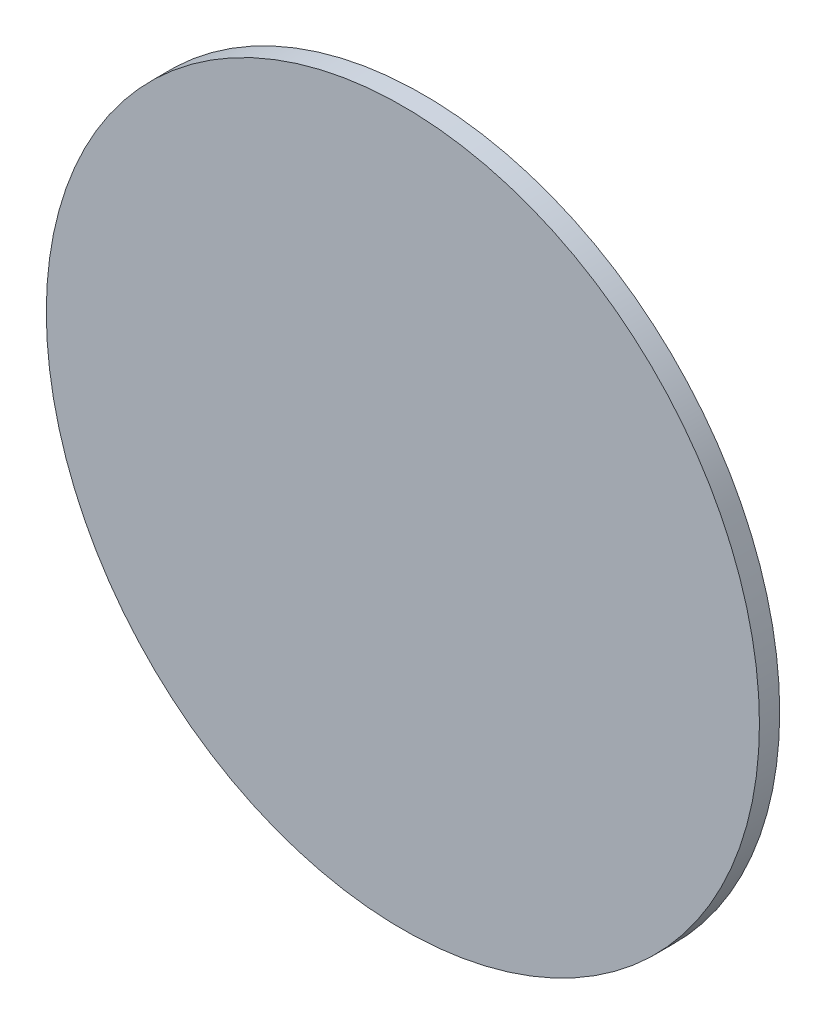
from build123d import *

# Parameters (mm, degrees)
CROQUIS1_R              = 88
SALIENTE_EXTRUIR1_DEPTH = 5


with BuildPart() as part:
    # Croquis1 → Saliente-Extruir1 (new body)
    with BuildSketch(Plane.XY):
        Circle(CROQUIS1_R)
    extrude(amount=SALIENTE_EXTRUIR1_DEPTH)


solid = part.part
